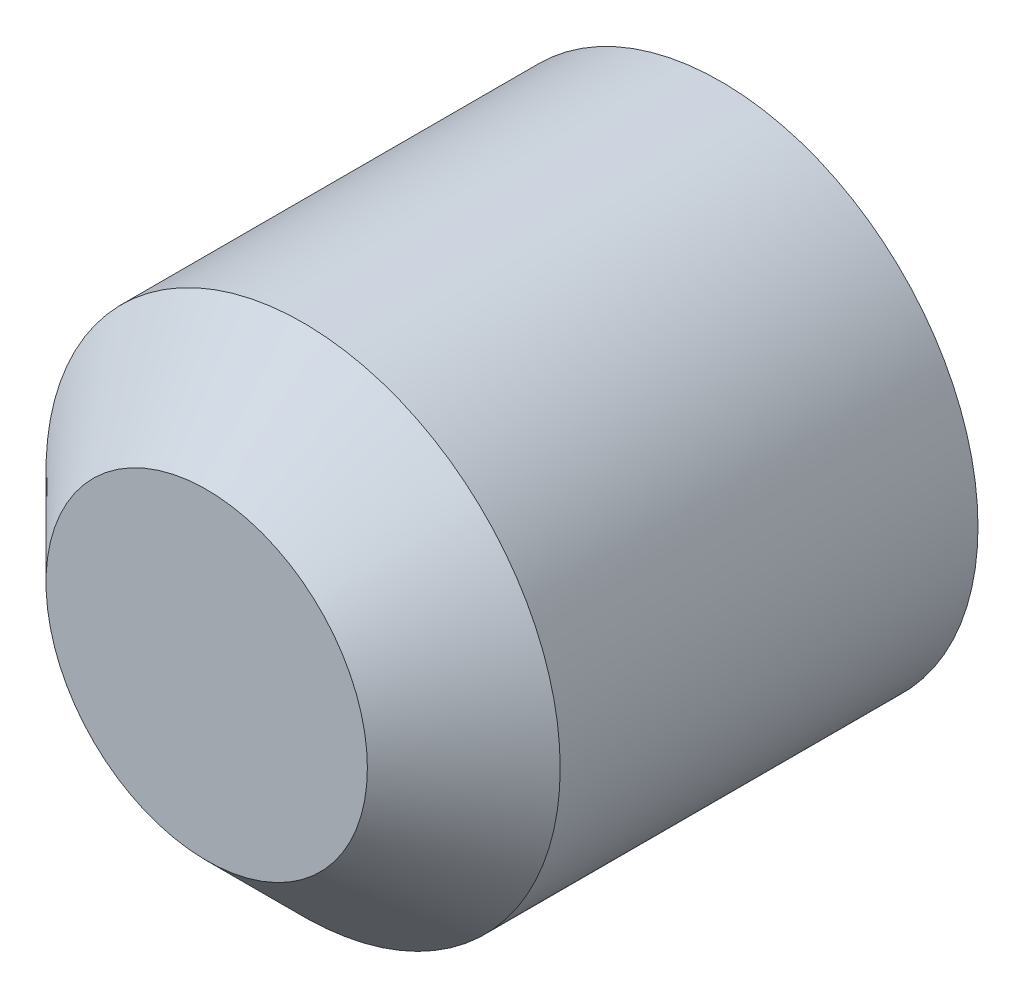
ISO-10303-21;
HEADER;
FILE_DESCRIPTION(('STEP AP214'),'2;1');
FILE_NAME('part.step','',(''),(''),'','','');
FILE_SCHEMA(('AUTOMOTIVE_DESIGN { 1 0 10303 214 1 1 1 1 }'));
ENDSEC;
DATA;
#1=APPLICATION_CONTEXT('core data for automotive mechanical design processes');
#2=APPLICATION_PROTOCOL_DEFINITION('international standard','automotive_design',2000,#1);
#3=PRODUCT_CONTEXT('',#1,'mechanical');
#4=PRODUCT('Part','Part','',(#3));
#5=PRODUCT_RELATED_PRODUCT_CATEGORY('part','',(#4));
#6=PRODUCT_DEFINITION_FORMATION('','',#4);
#7=PRODUCT_DEFINITION_CONTEXT('part definition',#1,'design');
#8=PRODUCT_DEFINITION('design','',#6,#7);
#9=PRODUCT_DEFINITION_SHAPE('','',#8);
#10=(LENGTH_UNIT() NAMED_UNIT(*) SI_UNIT(.MILLI.,.METRE.));
#11=(NAMED_UNIT(*) PLANE_ANGLE_UNIT() SI_UNIT($,.RADIAN.));
#12=(NAMED_UNIT(*) SI_UNIT($,.STERADIAN.) SOLID_ANGLE_UNIT());
#13=UNCERTAINTY_MEASURE_WITH_UNIT(LENGTH_MEASURE(1.E-05),#10,'distance_accuracy_value','');
#14=(GEOMETRIC_REPRESENTATION_CONTEXT(3) GLOBAL_UNCERTAINTY_ASSIGNED_CONTEXT((#13)) GLOBAL_UNIT_ASSIGNED_CONTEXT((#10,
#11,#12)) REPRESENTATION_CONTEXT('',''));
#15=CARTESIAN_POINT('',(0.,0.,0.));
#16=DIRECTION('',(0.,0.,1.));
#17=DIRECTION('',(1.,0.,0.));
#18=AXIS2_PLACEMENT_3D('',#15,#16,#17);
#19=CARTESIAN_POINT('',(0.,0.,4.));
#20=DIRECTION('',(0.,0.,-1.));
#21=DIRECTION('',(-1.,0.,0.));
#22=AXIS2_PLACEMENT_3D('',#19,#20,#21);
#23=CYLINDRICAL_SURFACE('',#22,2.);
#24=CARTESIAN_POINT('',(0.,0.,3.25));
#25=DIRECTION('',(0.,0.,1.));
#26=DIRECTION('',(1.,0.,0.));
#27=AXIS2_PLACEMENT_3D('',#24,#25,#26);
#28=CIRCLE('',#27,2.);
#29=CARTESIAN_POINT('',(2.00000000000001,0.,3.25));
#30=VERTEX_POINT('',#29);
#31=EDGE_CURVE('E10',#30,#30,#28,.F.);
#32=ORIENTED_EDGE('',*,*,#31,.T.);
#33=EDGE_LOOP('',(#32));
#34=FACE_BOUND('',#33,.T.);
#35=CARTESIAN_POINT('',(0.,0.,0.));
#36=DIRECTION('',(0.,0.,1.));
#37=DIRECTION('',(1.,0.,0.));
#38=AXIS2_PLACEMENT_3D('',#35,#36,#37);
#39=CIRCLE('',#38,2.);
#40=CARTESIAN_POINT('',(2.,0.,0.));
#41=VERTEX_POINT('',#40);
#42=EDGE_CURVE('E43',#41,#41,#39,.T.);
#43=ORIENTED_EDGE('',*,*,#42,.T.);
#44=EDGE_LOOP('',(#43));
#45=FACE_BOUND('',#44,.T.);
#46=ADVANCED_FACE('F33',(#34,#45),#23,.T.);
#47=CARTESIAN_POINT('',(0.,0.,4.));
#48=DIRECTION('',(0.,0.,1.));
#49=DIRECTION('',(1.,0.,0.));
#50=AXIS2_PLACEMENT_3D('',#47,#48,#49);
#51=PLANE('',#50);
#52=CARTESIAN_POINT('',(0.,0.,4.));
#53=DIRECTION('',(0.,0.,1.));
#54=DIRECTION('',(1.,0.,0.));
#55=AXIS2_PLACEMENT_3D('',#52,#53,#54);
#56=CIRCLE('',#55,1.24999999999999);
#57=CARTESIAN_POINT('',(1.24999999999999,0.,4.));
#58=VERTEX_POINT('',#57);
#59=EDGE_CURVE('E39',#58,#58,#56,.T.);
#60=ORIENTED_EDGE('',*,*,#59,.T.);
#61=EDGE_LOOP('',(#60));
#62=FACE_BOUND('',#61,.T.);
#63=ADVANCED_FACE('F54',(#62),#51,.T.);
#64=CARTESIAN_POINT('',(0.,0.,0.));
#65=DIRECTION('',(0.,0.,1.));
#66=DIRECTION('',(1.,0.,0.));
#67=AXIS2_PLACEMENT_3D('',#64,#65,#66);
#68=PLANE('',#67);
#69=ORIENTED_EDGE('',*,*,#42,.F.);
#70=EDGE_LOOP('',(#69));
#71=FACE_BOUND('',#70,.T.);
#72=ADVANCED_FACE('F51',(#71),#68,.F.);
#73=CARTESIAN_POINT('',(0.,0.,4.));
#74=DIRECTION('',(0.,0.,-1.));
#75=DIRECTION('',(-1.,0.,0.));
#76=AXIS2_PLACEMENT_3D('',#73,#74,#75);
#77=CONICAL_SURFACE('',#76,1.24999999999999,0.785398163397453);
#78=ORIENTED_EDGE('',*,*,#31,.F.);
#79=EDGE_LOOP('',(#78));
#80=FACE_BOUND('',#79,.T.);
#81=ORIENTED_EDGE('',*,*,#59,.F.);
#82=EDGE_LOOP('',(#81));
#83=FACE_BOUND('',#82,.T.);
#84=ADVANCED_FACE('F53',(#80,#83),#77,.T.);
#85=CLOSED_SHELL('',(#46,#63,#72,#84));
#86=MANIFOLD_SOLID_BREP('B2',#85);
#87=ADVANCED_BREP_SHAPE_REPRESENTATION('',(#18,#86),#14);
#88=SHAPE_DEFINITION_REPRESENTATION(#9,#87);
ENDSEC;
END-ISO-10303-21;
